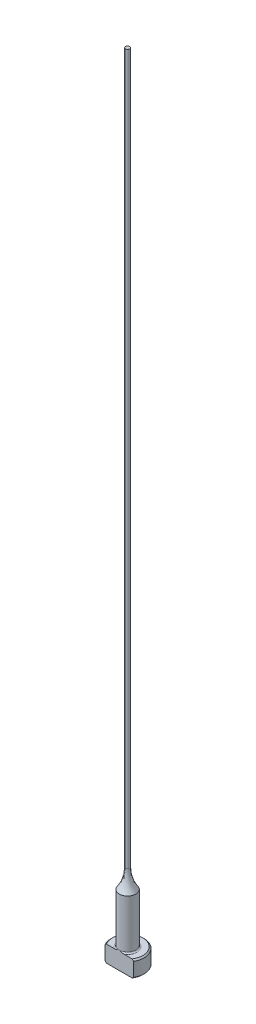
from build123d import *

# Parameters (mm, degrees)
CHAMFER1_SIZE = 0.254
FILLET1_R     = 0.254
KEY_DEPTH     = 153.466131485


with BuildPart() as part:
    # Sketch1 → Revolve1 (revolve)
    with BuildSketch(Plane.XY, mode=Mode.PRIVATE) as revolve1_sk:
        with BuildLine():
            Line((0, 0), (-3.175, 0))
            Line((-3.175, 0), (-3.175, 3.175))
            Line((-3.175, 3.175), (-1.5875, 3.175))
            Line((-1.5875, 3.175), (-1.5875, 12.7))
            ThreePointArc((-1.5875, 12.7), (-0.701386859, 14.457887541), (-0.39624, 16.40268843))
            Line((-0.39624, 16.40268843), (-0.39624, 152.4))
            Line((-0.39624, 152.4), (0, 152.4))
            Line((0, 152.4), (0, 0))
        make_face()
    revolve(revolve1_sk.sketch.rotate(Axis((0, 259.958771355, 0), (0, -1, 0)), 270), axis=Axis((0, 259.958771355, 0), (0, -1, 0)))

    # Chamfer1
    chamfer1_edges = [part.edges().sort_by_distance(p)[0] for p in [
        (0, 0, -3.175),
        (0, 3.175, -3.175),
    ]]
    chamfer(chamfer1_edges, length=CHAMFER1_SIZE)

    # Fillet1
    fillet1_edges = [part.edges().sort_by_distance(p)[0] for p in [
        (0, 3.175, -1.5875),
    ]]
    fillet(fillet1_edges, radius=FILLET1_R)

    # Sketch2 → KEY (cut, through all)
    with BuildSketch(Plane.XZ):
        with BuildLine():
            Line((-2.749630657, 1.5875), (2.749630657, 1.5875))
            ThreePointArc((2.749630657, 1.5875), (0, 3.175), (-2.749630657, 1.5875))
        make_face()
    extrude(amount=-KEY_DEPTH, mode=Mode.SUBTRACT)


solid = part.part
